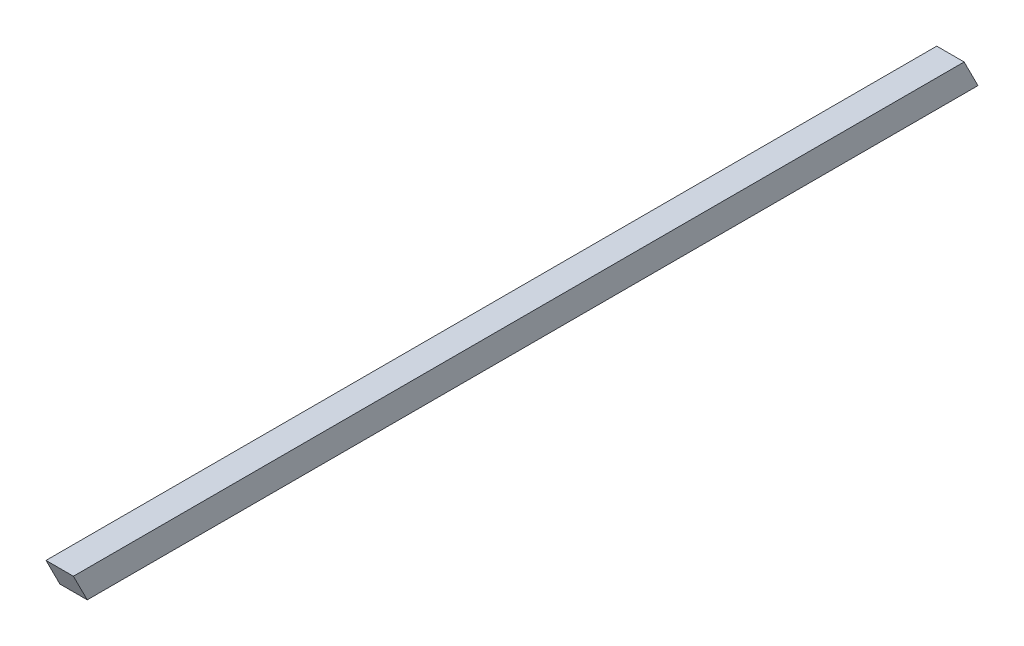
ISO-10303-21;
HEADER;
FILE_DESCRIPTION(('STEP AP214'),'2;1');
FILE_NAME('part.step','',(''),(''),'','','');
FILE_SCHEMA(('AUTOMOTIVE_DESIGN { 1 0 10303 214 1 1 1 1 }'));
ENDSEC;
DATA;
#1=APPLICATION_CONTEXT('core data for automotive mechanical design processes');
#2=APPLICATION_PROTOCOL_DEFINITION('international standard','automotive_design',2000,#1);
#3=PRODUCT_CONTEXT('',#1,'mechanical');
#4=PRODUCT('Part','Part','',(#3));
#5=PRODUCT_RELATED_PRODUCT_CATEGORY('part','',(#4));
#6=PRODUCT_DEFINITION_FORMATION('','',#4);
#7=PRODUCT_DEFINITION_CONTEXT('part definition',#1,'design');
#8=PRODUCT_DEFINITION('design','',#6,#7);
#9=PRODUCT_DEFINITION_SHAPE('','',#8);
#10=(LENGTH_UNIT() NAMED_UNIT(*) SI_UNIT(.MILLI.,.METRE.));
#11=(NAMED_UNIT(*) PLANE_ANGLE_UNIT() SI_UNIT($,.RADIAN.));
#12=(NAMED_UNIT(*) SI_UNIT($,.STERADIAN.) SOLID_ANGLE_UNIT());
#13=UNCERTAINTY_MEASURE_WITH_UNIT(LENGTH_MEASURE(1.E-05),#10,'distance_accuracy_value','');
#14=(GEOMETRIC_REPRESENTATION_CONTEXT(3) GLOBAL_UNCERTAINTY_ASSIGNED_CONTEXT((#13)) GLOBAL_UNIT_ASSIGNED_CONTEXT((#10,
#11,#12)) REPRESENTATION_CONTEXT('',''));
#15=CARTESIAN_POINT('',(0.,0.,0.));
#16=DIRECTION('',(0.,0.,1.));
#17=DIRECTION('',(1.,0.,0.));
#18=AXIS2_PLACEMENT_3D('',#15,#16,#17);
#19=CARTESIAN_POINT('',(-2.,2.,65.));
#20=DIRECTION('',(1.,0.,0.));
#21=DIRECTION('',(0.,0.,-1.));
#22=AXIS2_PLACEMENT_3D('',#19,#20,#21);
#23=PLANE('',#22);
#24=DIRECTION('',(0.,0.,-1.));
#25=VECTOR('',#24,1.);
#26=CARTESIAN_POINT('',(-2.,2.,65.));
#27=LINE('',#26,#25);
#28=CARTESIAN_POINT('',(-2.,2.,67.0222982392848));
#29=VERTEX_POINT('',#28);
#30=CARTESIAN_POINT('',(-2.,2.,-62.9777017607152));
#31=VERTEX_POINT('',#30);
#32=EDGE_CURVE('E69',#29,#31,#27,.T.);
#33=ORIENTED_EDGE('',*,*,#32,.T.);
#34=DIRECTION('',(0.,0.892428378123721,0.45118908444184));
#35=VECTOR('',#34,1.);
#36=CARTESIAN_POINT('',(-2.,-2.,-65.));
#37=LINE('',#36,#35);
#38=CARTESIAN_POINT('',(-2.,-2.,-65.));
#39=VERTEX_POINT('',#38);
#40=EDGE_CURVE('E87',#39,#31,#37,.T.);
#41=ORIENTED_EDGE('',*,*,#40,.F.);
#42=DIRECTION('',(0.,0.,-1.));
#43=VECTOR('',#42,1.);
#44=CARTESIAN_POINT('',(-2.,-2.,65.));
#45=LINE('',#44,#43);
#46=CARTESIAN_POINT('',(-2.,-2.,65.));
#47=VERTEX_POINT('',#46);
#48=EDGE_CURVE('E11',#47,#39,#45,.T.);
#49=ORIENTED_EDGE('',*,*,#48,.F.);
#50=DIRECTION('',(0.,0.892428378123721,0.45118908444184));
#51=VECTOR('',#50,1.);
#52=CARTESIAN_POINT('',(-2.,2.,67.0222982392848));
#53=LINE('',#52,#51);
#54=EDGE_CURVE('E84',#47,#29,#53,.T.);
#55=ORIENTED_EDGE('',*,*,#54,.T.);
#56=EDGE_LOOP('',(#33,#41,#49,#55));
#57=FACE_BOUND('',#56,.T.);
#58=ADVANCED_FACE('F30',(#57),#23,.F.);
#59=CARTESIAN_POINT('',(-2.,-2.,65.));
#60=DIRECTION('',(0.,1.,0.));
#61=DIRECTION('',(0.,0.,1.));
#62=AXIS2_PLACEMENT_3D('',#59,#60,#61);
#63=PLANE('',#62);
#64=DIRECTION('',(1.,0.,0.));
#65=VECTOR('',#64,1.);
#66=CARTESIAN_POINT('',(-2.,-2.,-65.));
#67=LINE('',#66,#65);
#68=CARTESIAN_POINT('',(2.,-2.,-65.));
#69=VERTEX_POINT('',#68);
#70=EDGE_CURVE('E97',#39,#69,#67,.T.);
#71=ORIENTED_EDGE('',*,*,#70,.T.);
#72=DIRECTION('',(0.,0.,-1.));
#73=VECTOR('',#72,1.);
#74=CARTESIAN_POINT('',(2.,-2.,65.));
#75=LINE('',#74,#73);
#76=CARTESIAN_POINT('',(2.,-2.,65.));
#77=VERTEX_POINT('',#76);
#78=EDGE_CURVE('E37',#77,#69,#75,.T.);
#79=ORIENTED_EDGE('',*,*,#78,.F.);
#80=DIRECTION('',(1.,0.,0.));
#81=VECTOR('',#80,1.);
#82=CARTESIAN_POINT('',(-2.,-2.,65.));
#83=LINE('',#82,#81);
#84=EDGE_CURVE('E46',#47,#77,#83,.T.);
#85=ORIENTED_EDGE('',*,*,#84,.F.);
#86=ORIENTED_EDGE('',*,*,#48,.T.);
#87=EDGE_LOOP('',(#71,#79,#85,#86));
#88=FACE_BOUND('',#87,.T.);
#89=ADVANCED_FACE('F104',(#88),#63,.F.);
#90=CARTESIAN_POINT('',(2.,2.,65.));
#91=DIRECTION('',(-1.,0.,0.));
#92=DIRECTION('',(0.,-1.,0.));
#93=AXIS2_PLACEMENT_3D('',#90,#91,#92);
#94=PLANE('',#93);
#95=ORIENTED_EDGE('',*,*,#78,.T.);
#96=DIRECTION('',(0.,0.892428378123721,0.45118908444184));
#97=VECTOR('',#96,1.);
#98=CARTESIAN_POINT('',(1.99999999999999,53.5307262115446,-36.9250775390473));
#99=LINE('',#98,#97);
#100=CARTESIAN_POINT('',(2.,2.,-62.9777017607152));
#101=VERTEX_POINT('',#100);
#102=EDGE_CURVE('E94',#69,#101,#99,.T.);
#103=ORIENTED_EDGE('',*,*,#102,.T.);
#104=DIRECTION('',(0.,0.,-1.));
#105=VECTOR('',#104,1.);
#106=CARTESIAN_POINT('',(2.,2.,65.));
#107=LINE('',#106,#105);
#108=CARTESIAN_POINT('',(2.,2.,67.0222982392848));
#109=VERTEX_POINT('',#108);
#110=EDGE_CURVE('E79',#109,#101,#107,.T.);
#111=ORIENTED_EDGE('',*,*,#110,.F.);
#112=DIRECTION('',(0.,0.892428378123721,0.45118908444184));
#113=VECTOR('',#112,1.);
#114=CARTESIAN_POINT('',(2.,2.,67.0222982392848));
#115=LINE('',#114,#113);
#116=EDGE_CURVE('E86',#77,#109,#115,.T.);
#117=ORIENTED_EDGE('',*,*,#116,.F.);
#118=EDGE_LOOP('',(#95,#103,#111,#117));
#119=FACE_BOUND('',#118,.T.);
#120=ADVANCED_FACE('F101',(#119),#94,.F.);
#121=CARTESIAN_POINT('',(-2.,2.,65.));
#122=DIRECTION('',(0.,-1.,0.));
#123=DIRECTION('',(1.,0.,0.));
#124=AXIS2_PLACEMENT_3D('',#121,#122,#123);
#125=PLANE('',#124);
#126=ORIENTED_EDGE('',*,*,#110,.T.);
#127=DIRECTION('',(-1.,0.,0.));
#128=VECTOR('',#127,1.);
#129=CARTESIAN_POINT('',(298.,2.,-62.9777017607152));
#130=LINE('',#129,#128);
#131=EDGE_CURVE('E75',#101,#31,#130,.T.);
#132=ORIENTED_EDGE('',*,*,#131,.T.);
#133=ORIENTED_EDGE('',*,*,#32,.F.);
#134=DIRECTION('',(-1.,0.,0.));
#135=VECTOR('',#134,1.);
#136=CARTESIAN_POINT('',(2.,2.,67.0222982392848));
#137=LINE('',#136,#135);
#138=EDGE_CURVE('E73',#109,#29,#137,.T.);
#139=ORIENTED_EDGE('',*,*,#138,.F.);
#140=EDGE_LOOP('',(#126,#132,#133,#139));
#141=FACE_BOUND('',#140,.T.);
#142=ADVANCED_FACE('F72',(#141),#125,.F.);
#143=CARTESIAN_POINT('',(298.,-2.,-65.));
#144=DIRECTION('',(0.,-0.45118908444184,0.892428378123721));
#145=DIRECTION('',(0.,-0.892428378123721,-0.45118908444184));
#146=AXIS2_PLACEMENT_3D('',#143,#144,#145);
#147=PLANE('',#146);
#148=ORIENTED_EDGE('',*,*,#70,.F.);
#149=ORIENTED_EDGE('',*,*,#40,.T.);
#150=ORIENTED_EDGE('',*,*,#131,.F.);
#151=ORIENTED_EDGE('',*,*,#102,.F.);
#152=EDGE_LOOP('',(#148,#149,#150,#151));
#153=FACE_BOUND('',#152,.T.);
#154=ADVANCED_FACE('F103',(#153),#147,.F.);
#155=CARTESIAN_POINT('',(2.,2.,67.0222982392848));
#156=DIRECTION('',(0.,-0.45118908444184,0.892428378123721));
#157=DIRECTION('',(0.,-0.892428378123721,-0.45118908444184));
#158=AXIS2_PLACEMENT_3D('',#155,#156,#157);
#159=PLANE('',#158);
#160=ORIENTED_EDGE('',*,*,#54,.F.);
#161=ORIENTED_EDGE('',*,*,#84,.T.);
#162=ORIENTED_EDGE('',*,*,#116,.T.);
#163=ORIENTED_EDGE('',*,*,#138,.T.);
#164=EDGE_LOOP('',(#160,#161,#162,#163));
#165=FACE_BOUND('',#164,.T.);
#166=ADVANCED_FACE('F83',(#165),#159,.T.);
#167=CLOSED_SHELL('',(#58,#89,#120,#142,#154,#166));
#168=MANIFOLD_SOLID_BREP('B2',#167);
#169=ADVANCED_BREP_SHAPE_REPRESENTATION('',(#18,#168),#14);
#170=SHAPE_DEFINITION_REPRESENTATION(#9,#169);
ENDSEC;
END-ISO-10303-21;
